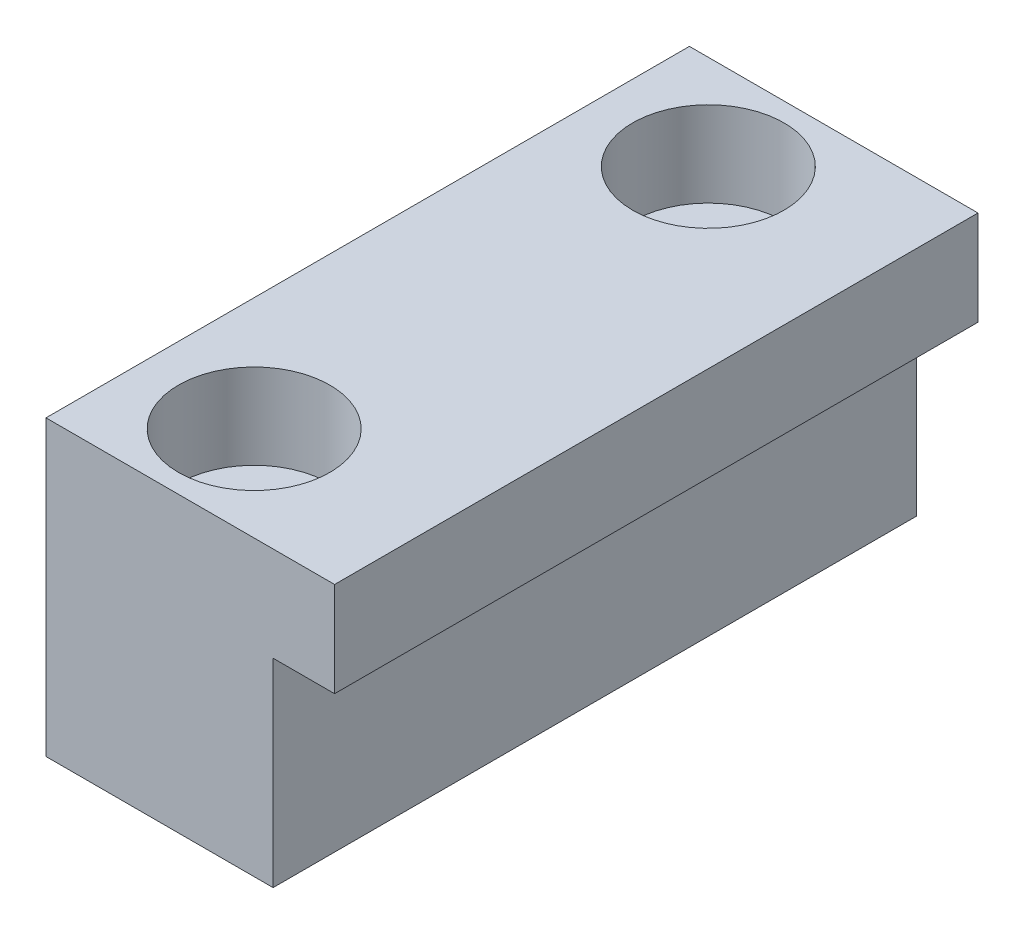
from build123d import *

# Parameters (mm, degrees)
EXTRUDE_1_DEPTH     = 34
SKETCH_2_R          = 2.25
CUT_EXTRUDE_1_DEPTH = 34
SKETCH_3_R          = 4
CUT_EXTRUDE_2_DEPTH = 4.5


with BuildPart() as part:
    # Sketch 1 → Extrude 1 (new body)
    with BuildSketch(Plane.XY):
        Polygon((12, 0), (12, 10.5), (15.25, 10.5), (15.25, 15.5), (0, 15.5), (0, 0), align=None)
    extrude(amount=EXTRUDE_1_DEPTH)

    # Sketch 2 → Cut-Extrude 1 (cut)
    with BuildSketch(Plane(origin=(0, 15.5, 0), x_dir=(1, 0, 0), z_dir=(0, 1, 0))):
        with Locations(Location((6, -29, 0), (0, 0, 270))):
            Circle(SKETCH_2_R)
        with Locations(Location((6, -5, 0), (0, 0, 270))):
            Circle(SKETCH_2_R)
    extrude(amount=-CUT_EXTRUDE_1_DEPTH, mode=Mode.SUBTRACT)

    # Sketch 3 → Cut-Extrude 2 (cut)
    with BuildSketch(Plane(origin=(0, 15.5, 0), x_dir=(1, 0, 0), z_dir=(0, 1, 0))):
        with Locations(Location((6, -29, 0), (0, 0, 270))):
            Circle(SKETCH_3_R)
        with Locations(Location((6, -5, 0), (0, 0, 270))):
            Circle(SKETCH_3_R)
    extrude(amount=-CUT_EXTRUDE_2_DEPTH, mode=Mode.SUBTRACT)


solid = part.part
